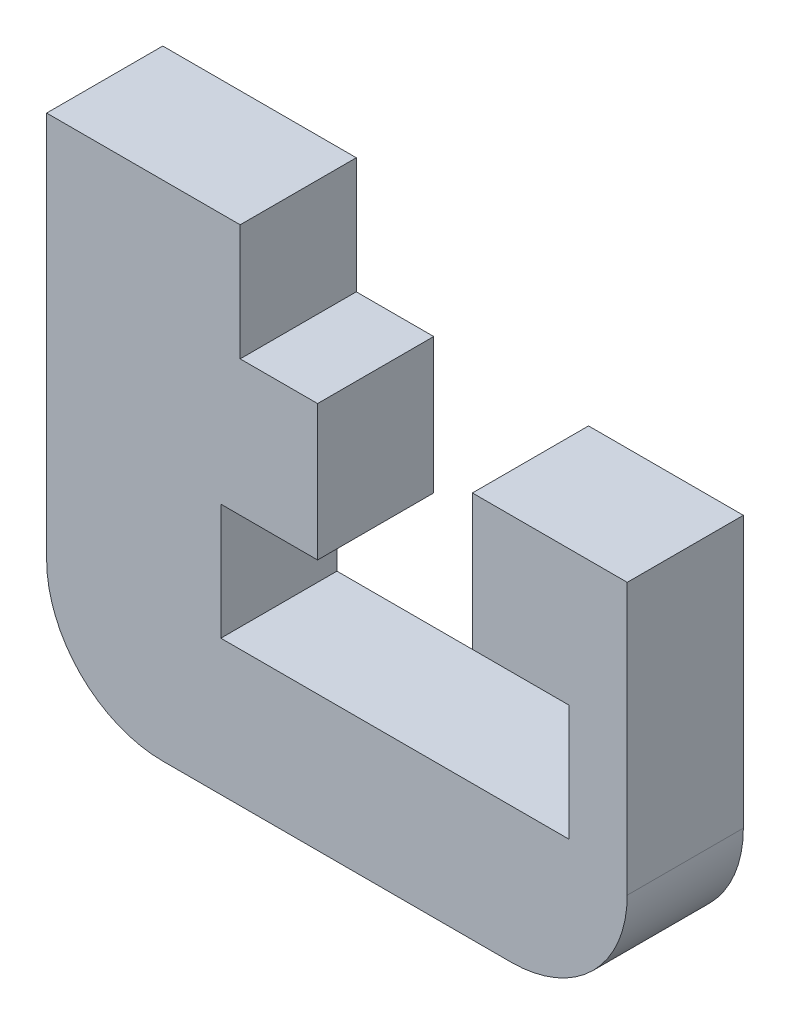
ISO-10303-21;
HEADER;
FILE_DESCRIPTION(('STEP AP214'),'2;1');
FILE_NAME('part.step','',(''),(''),'','','');
FILE_SCHEMA(('AUTOMOTIVE_DESIGN { 1 0 10303 214 1 1 1 1 }'));
ENDSEC;
DATA;
#1=APPLICATION_CONTEXT('core data for automotive mechanical design processes');
#2=APPLICATION_PROTOCOL_DEFINITION('international standard','automotive_design',2000,#1);
#3=PRODUCT_CONTEXT('',#1,'mechanical');
#4=PRODUCT('Part','Part','',(#3));
#5=PRODUCT_RELATED_PRODUCT_CATEGORY('part','',(#4));
#6=PRODUCT_DEFINITION_FORMATION('','',#4);
#7=PRODUCT_DEFINITION_CONTEXT('part definition',#1,'design');
#8=PRODUCT_DEFINITION('design','',#6,#7);
#9=PRODUCT_DEFINITION_SHAPE('','',#8);
#10=(LENGTH_UNIT() NAMED_UNIT(*) SI_UNIT(.MILLI.,.METRE.));
#11=(NAMED_UNIT(*) PLANE_ANGLE_UNIT() SI_UNIT($,.RADIAN.));
#12=(NAMED_UNIT(*) SI_UNIT($,.STERADIAN.) SOLID_ANGLE_UNIT());
#13=UNCERTAINTY_MEASURE_WITH_UNIT(LENGTH_MEASURE(1.E-05),#10,'distance_accuracy_value','');
#14=(GEOMETRIC_REPRESENTATION_CONTEXT(3) GLOBAL_UNCERTAINTY_ASSIGNED_CONTEXT((#13)) GLOBAL_UNIT_ASSIGNED_CONTEXT((#10,
#11,#12)) REPRESENTATION_CONTEXT('',''));
#15=CARTESIAN_POINT('',(0.,0.,0.));
#16=DIRECTION('',(0.,0.,1.));
#17=DIRECTION('',(1.,0.,0.));
#18=AXIS2_PLACEMENT_3D('',#15,#16,#17);
#19=CARTESIAN_POINT('',(-2.,12.0010272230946,3.));
#20=DIRECTION('',(0.,0.,-1.));
#21=DIRECTION('',(-1.,0.,0.));
#22=AXIS2_PLACEMENT_3D('',#19,#20,#21);
#23=CYLINDRICAL_SURFACE('',#22,3.);
#24=CARTESIAN_POINT('',(-2.,12.0010272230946,0.));
#25=DIRECTION('',(0.,0.,1.));
#26=DIRECTION('',(1.,0.,0.));
#27=AXIS2_PLACEMENT_3D('',#24,#25,#26);
#28=CIRCLE('',#27,3.);
#29=CARTESIAN_POINT('',(-5.,12.0010272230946,0.));
#30=VERTEX_POINT('',#29);
#31=CARTESIAN_POINT('',(-1.99999999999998,9.00102722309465,0.));
#32=VERTEX_POINT('',#31);
#33=EDGE_CURVE('E179',#30,#32,#28,.T.);
#34=ORIENTED_EDGE('',*,*,#33,.T.);
#35=DIRECTION('',(0.,0.,-1.));
#36=VECTOR('',#35,1.);
#37=CARTESIAN_POINT('',(-1.99999999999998,9.00102722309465,3.));
#38=LINE('',#37,#36);
#39=CARTESIAN_POINT('',(-1.99999999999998,9.00102722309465,3.));
#40=VERTEX_POINT('',#39);
#41=EDGE_CURVE('E11',#40,#32,#38,.T.);
#42=ORIENTED_EDGE('',*,*,#41,.F.);
#43=CARTESIAN_POINT('',(-2.,12.0010272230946,3.));
#44=DIRECTION('',(0.,0.,1.));
#45=DIRECTION('',(1.,0.,0.));
#46=AXIS2_PLACEMENT_3D('',#43,#44,#45);
#47=CIRCLE('',#46,3.);
#48=CARTESIAN_POINT('',(-5.,12.0010272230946,3.));
#49=VERTEX_POINT('',#48);
#50=EDGE_CURVE('E209',#49,#40,#47,.T.);
#51=ORIENTED_EDGE('',*,*,#50,.F.);
#52=DIRECTION('',(0.,0.,-1.));
#53=VECTOR('',#52,1.);
#54=CARTESIAN_POINT('',(-5.,12.0010272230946,3.));
#55=LINE('',#54,#53);
#56=EDGE_CURVE('E175',#49,#30,#55,.T.);
#57=ORIENTED_EDGE('',*,*,#56,.T.);
#58=EDGE_LOOP('',(#34,#42,#51,#57));
#59=FACE_BOUND('',#58,.T.);
#60=ADVANCED_FACE('F35',(#59),#23,.T.);
#61=CARTESIAN_POINT('',(6.99999999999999,9.00102722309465,3.));
#62=DIRECTION('',(0.,1.,0.));
#63=DIRECTION('',(0.,0.,1.));
#64=AXIS2_PLACEMENT_3D('',#61,#62,#63);
#65=PLANE('',#64);
#66=DIRECTION('',(1.,0.,0.));
#67=VECTOR('',#66,1.);
#68=CARTESIAN_POINT('',(6.99999999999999,9.00102722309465,0.));
#69=LINE('',#68,#67);
#70=CARTESIAN_POINT('',(6.99999999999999,9.00102722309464,0.));
#71=VERTEX_POINT('',#70);
#72=EDGE_CURVE('E182',#32,#71,#69,.T.);
#73=ORIENTED_EDGE('',*,*,#72,.T.);
#74=DIRECTION('',(0.,0.,-1.));
#75=VECTOR('',#74,1.);
#76=CARTESIAN_POINT('',(6.99999999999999,9.00102722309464,3.));
#77=LINE('',#76,#75);
#78=CARTESIAN_POINT('',(6.99999999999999,9.00102722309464,3.));
#79=VERTEX_POINT('',#78);
#80=EDGE_CURVE('E43',#79,#71,#77,.T.);
#81=ORIENTED_EDGE('',*,*,#80,.F.);
#82=DIRECTION('',(1.,0.,0.));
#83=VECTOR('',#82,1.);
#84=CARTESIAN_POINT('',(6.99999999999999,9.00102722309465,3.));
#85=LINE('',#84,#83);
#86=EDGE_CURVE('E118',#40,#79,#85,.T.);
#87=ORIENTED_EDGE('',*,*,#86,.F.);
#88=ORIENTED_EDGE('',*,*,#41,.T.);
#89=EDGE_LOOP('',(#73,#81,#87,#88));
#90=FACE_BOUND('',#89,.T.);
#91=ADVANCED_FACE('F307',(#90),#65,.F.);
#92=CARTESIAN_POINT('',(6.99999999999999,12.0010272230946,3.));
#93=DIRECTION('',(0.,0.,-1.));
#94=DIRECTION('',(-1.,0.,0.));
#95=AXIS2_PLACEMENT_3D('',#92,#93,#94);
#96=CYLINDRICAL_SURFACE('',#95,3.);
#97=CARTESIAN_POINT('',(6.99999999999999,12.0010272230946,0.));
#98=DIRECTION('',(0.,0.,1.));
#99=DIRECTION('',(-1.,0.,0.));
#100=AXIS2_PLACEMENT_3D('',#97,#98,#99);
#101=CIRCLE('',#100,3.);
#102=CARTESIAN_POINT('',(9.99999999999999,12.0010272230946,0.));
#103=VERTEX_POINT('',#102);
#104=EDGE_CURVE('E184',#71,#103,#101,.T.);
#105=ORIENTED_EDGE('',*,*,#104,.T.);
#106=DIRECTION('',(0.,0.,-1.));
#107=VECTOR('',#106,1.);
#108=CARTESIAN_POINT('',(9.99999999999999,12.0010272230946,3.));
#109=LINE('',#108,#107);
#110=CARTESIAN_POINT('',(9.99999999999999,12.0010272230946,3.));
#111=VERTEX_POINT('',#110);
#112=EDGE_CURVE('E240',#111,#103,#109,.T.);
#113=ORIENTED_EDGE('',*,*,#112,.F.);
#114=CARTESIAN_POINT('',(6.99999999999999,12.0010272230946,3.));
#115=DIRECTION('',(0.,0.,1.));
#116=DIRECTION('',(-1.,0.,0.));
#117=AXIS2_PLACEMENT_3D('',#114,#115,#116);
#118=CIRCLE('',#117,3.);
#119=EDGE_CURVE('E248',#79,#111,#118,.T.);
#120=ORIENTED_EDGE('',*,*,#119,.F.);
#121=ORIENTED_EDGE('',*,*,#80,.T.);
#122=EDGE_LOOP('',(#105,#113,#120,#121));
#123=FACE_BOUND('',#122,.T.);
#124=ADVANCED_FACE('F246',(#123),#96,.T.);
#125=CARTESIAN_POINT('',(9.99999999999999,19.0010272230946,3.));
#126=DIRECTION('',(-1.,0.,0.));
#127=DIRECTION('',(0.,0.,1.));
#128=AXIS2_PLACEMENT_3D('',#125,#126,#127);
#129=PLANE('',#128);
#130=DIRECTION('',(0.,1.,0.));
#131=VECTOR('',#130,1.);
#132=CARTESIAN_POINT('',(9.99999999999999,19.0010272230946,0.));
#133=LINE('',#132,#131);
#134=CARTESIAN_POINT('',(9.99999999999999,19.0010272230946,0.));
#135=VERTEX_POINT('',#134);
#136=EDGE_CURVE('E186',#103,#135,#133,.T.);
#137=ORIENTED_EDGE('',*,*,#136,.T.);
#138=DIRECTION('',(0.,0.,-1.));
#139=VECTOR('',#138,1.);
#140=CARTESIAN_POINT('',(9.99999999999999,19.0010272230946,3.));
#141=LINE('',#140,#139);
#142=CARTESIAN_POINT('',(9.99999999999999,19.0010272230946,3.));
#143=VERTEX_POINT('',#142);
#144=EDGE_CURVE('E237',#143,#135,#141,.T.);
#145=ORIENTED_EDGE('',*,*,#144,.F.);
#146=DIRECTION('',(0.,1.,0.));
#147=VECTOR('',#146,1.);
#148=CARTESIAN_POINT('',(9.99999999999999,19.0010272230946,3.));
#149=LINE('',#148,#147);
#150=EDGE_CURVE('E266',#111,#143,#149,.T.);
#151=ORIENTED_EDGE('',*,*,#150,.F.);
#152=ORIENTED_EDGE('',*,*,#112,.T.);
#153=EDGE_LOOP('',(#137,#145,#151,#152));
#154=FACE_BOUND('',#153,.T.);
#155=ADVANCED_FACE('F257',(#154),#129,.F.);
#156=CARTESIAN_POINT('',(6.,19.0010272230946,3.));
#157=DIRECTION('',(0.,-1.,0.));
#158=DIRECTION('',(0.,0.,-1.));
#159=AXIS2_PLACEMENT_3D('',#156,#157,#158);
#160=PLANE('',#159);
#161=DIRECTION('',(-1.,0.,0.));
#162=VECTOR('',#161,1.);
#163=CARTESIAN_POINT('',(6.,19.0010272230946,0.));
#164=LINE('',#163,#162);
#165=CARTESIAN_POINT('',(6.,19.0010272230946,0.));
#166=VERTEX_POINT('',#165);
#167=EDGE_CURVE('E188',#135,#166,#164,.T.);
#168=ORIENTED_EDGE('',*,*,#167,.T.);
#169=DIRECTION('',(0.,0.,-1.));
#170=VECTOR('',#169,1.);
#171=CARTESIAN_POINT('',(6.,19.0010272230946,3.));
#172=LINE('',#171,#170);
#173=CARTESIAN_POINT('',(6.,19.0010272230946,3.));
#174=VERTEX_POINT('',#173);
#175=EDGE_CURVE('E234',#174,#166,#172,.T.);
#176=ORIENTED_EDGE('',*,*,#175,.F.);
#177=DIRECTION('',(-1.,0.,0.));
#178=VECTOR('',#177,1.);
#179=CARTESIAN_POINT('',(6.,19.0010272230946,3.));
#180=LINE('',#179,#178);
#181=EDGE_CURVE('E263',#143,#174,#180,.T.);
#182=ORIENTED_EDGE('',*,*,#181,.F.);
#183=ORIENTED_EDGE('',*,*,#144,.T.);
#184=EDGE_LOOP('',(#168,#176,#182,#183));
#185=FACE_BOUND('',#184,.T.);
#186=ADVANCED_FACE('F261',(#185),#160,.F.);
#187=CARTESIAN_POINT('',(6.,19.0010272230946,3.));
#188=DIRECTION('',(1.,0.,0.));
#189=DIRECTION('',(0.,0.,-1.));
#190=AXIS2_PLACEMENT_3D('',#187,#188,#189);
#191=PLANE('',#190);
#192=DIRECTION('',(0.,-1.,0.));
#193=VECTOR('',#192,1.);
#194=CARTESIAN_POINT('',(6.,19.0010272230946,0.));
#195=LINE('',#194,#193);
#196=CARTESIAN_POINT('',(6.,15.5010272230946,0.));
#197=VERTEX_POINT('',#196);
#198=EDGE_CURVE('E190',#166,#197,#195,.T.);
#199=ORIENTED_EDGE('',*,*,#198,.T.);
#200=DIRECTION('',(0.,0.,-1.));
#201=VECTOR('',#200,1.);
#202=CARTESIAN_POINT('',(6.,15.5010272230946,3.));
#203=LINE('',#202,#201);
#204=CARTESIAN_POINT('',(6.,15.5010272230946,3.));
#205=VERTEX_POINT('',#204);
#206=EDGE_CURVE('E231',#205,#197,#203,.T.);
#207=ORIENTED_EDGE('',*,*,#206,.F.);
#208=DIRECTION('',(0.,-1.,0.));
#209=VECTOR('',#208,1.);
#210=CARTESIAN_POINT('',(6.,19.0010272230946,3.));
#211=LINE('',#210,#209);
#212=EDGE_CURVE('E265',#174,#205,#211,.T.);
#213=ORIENTED_EDGE('',*,*,#212,.F.);
#214=ORIENTED_EDGE('',*,*,#175,.T.);
#215=EDGE_LOOP('',(#199,#207,#213,#214));
#216=FACE_BOUND('',#215,.T.);
#217=ADVANCED_FACE('F320',(#216),#191,.F.);
#218=CARTESIAN_POINT('',(6.,15.5010272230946,3.));
#219=DIRECTION('',(0.,1.,0.));
#220=DIRECTION('',(0.,0.,1.));
#221=AXIS2_PLACEMENT_3D('',#218,#219,#220);
#222=PLANE('',#221);
#223=DIRECTION('',(1.,0.,0.));
#224=VECTOR('',#223,1.);
#225=CARTESIAN_POINT('',(6.,15.5010272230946,0.));
#226=LINE('',#225,#224);
#227=CARTESIAN_POINT('',(8.5,15.5010272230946,0.));
#228=VERTEX_POINT('',#227);
#229=EDGE_CURVE('E192',#197,#228,#226,.T.);
#230=ORIENTED_EDGE('',*,*,#229,.T.);
#231=DIRECTION('',(0.,0.,-1.));
#232=VECTOR('',#231,1.);
#233=CARTESIAN_POINT('',(8.5,15.5010272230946,3.));
#234=LINE('',#233,#232);
#235=CARTESIAN_POINT('',(8.5,15.5010272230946,3.));
#236=VERTEX_POINT('',#235);
#237=EDGE_CURVE('E228',#236,#228,#234,.T.);
#238=ORIENTED_EDGE('',*,*,#237,.F.);
#239=DIRECTION('',(1.,0.,0.));
#240=VECTOR('',#239,1.);
#241=CARTESIAN_POINT('',(6.,15.5010272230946,3.));
#242=LINE('',#241,#240);
#243=EDGE_CURVE('E268',#205,#236,#242,.T.);
#244=ORIENTED_EDGE('',*,*,#243,.F.);
#245=ORIENTED_EDGE('',*,*,#206,.T.);
#246=EDGE_LOOP('',(#230,#238,#244,#245));
#247=FACE_BOUND('',#246,.T.);
#248=ADVANCED_FACE('F323',(#247),#222,.F.);
#249=CARTESIAN_POINT('',(8.5,15.5010272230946,3.));
#250=DIRECTION('',(1.,0.,0.));
#251=DIRECTION('',(0.,0.,-1.));
#252=AXIS2_PLACEMENT_3D('',#249,#250,#251);
#253=PLANE('',#252);
#254=DIRECTION('',(0.,-1.,0.));
#255=VECTOR('',#254,1.);
#256=CARTESIAN_POINT('',(8.5,15.5010272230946,0.));
#257=LINE('',#256,#255);
#258=CARTESIAN_POINT('',(8.5,12.5010272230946,0.));
#259=VERTEX_POINT('',#258);
#260=EDGE_CURVE('E194',#228,#259,#257,.T.);
#261=ORIENTED_EDGE('',*,*,#260,.T.);
#262=DIRECTION('',(0.,0.,-1.));
#263=VECTOR('',#262,1.);
#264=CARTESIAN_POINT('',(8.5,12.5010272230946,3.));
#265=LINE('',#264,#263);
#266=CARTESIAN_POINT('',(8.5,12.5010272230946,3.));
#267=VERTEX_POINT('',#266);
#268=EDGE_CURVE('E225',#267,#259,#265,.T.);
#269=ORIENTED_EDGE('',*,*,#268,.F.);
#270=DIRECTION('',(0.,-1.,0.));
#271=VECTOR('',#270,1.);
#272=CARTESIAN_POINT('',(8.5,15.5010272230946,3.));
#273=LINE('',#272,#271);
#274=EDGE_CURVE('E274',#236,#267,#273,.T.);
#275=ORIENTED_EDGE('',*,*,#274,.F.);
#276=ORIENTED_EDGE('',*,*,#237,.T.);
#277=EDGE_LOOP('',(#261,#269,#275,#276));
#278=FACE_BOUND('',#277,.T.);
#279=ADVANCED_FACE('F327',(#278),#253,.F.);
#280=CARTESIAN_POINT('',(8.5,12.5010272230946,3.));
#281=DIRECTION('',(0.,-1.,0.));
#282=DIRECTION('',(1.,0.,0.));
#283=AXIS2_PLACEMENT_3D('',#280,#281,#282);
#284=PLANE('',#283);
#285=DIRECTION('',(-1.,0.,0.));
#286=VECTOR('',#285,1.);
#287=CARTESIAN_POINT('',(8.5,12.5010272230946,0.));
#288=LINE('',#287,#286);
#289=CARTESIAN_POINT('',(-0.5,12.5010272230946,0.));
#290=VERTEX_POINT('',#289);
#291=EDGE_CURVE('E196',#259,#290,#288,.T.);
#292=ORIENTED_EDGE('',*,*,#291,.T.);
#293=DIRECTION('',(0.,0.,-1.));
#294=VECTOR('',#293,1.);
#295=CARTESIAN_POINT('',(-0.5,12.5010272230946,3.));
#296=LINE('',#295,#294);
#297=CARTESIAN_POINT('',(-0.5,12.5010272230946,3.));
#298=VERTEX_POINT('',#297);
#299=EDGE_CURVE('E222',#298,#290,#296,.T.);
#300=ORIENTED_EDGE('',*,*,#299,.F.);
#301=DIRECTION('',(-1.,0.,0.));
#302=VECTOR('',#301,1.);
#303=CARTESIAN_POINT('',(8.5,12.5010272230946,3.));
#304=LINE('',#303,#302);
#305=EDGE_CURVE('E276',#267,#298,#304,.T.);
#306=ORIENTED_EDGE('',*,*,#305,.F.);
#307=ORIENTED_EDGE('',*,*,#268,.T.);
#308=EDGE_LOOP('',(#292,#300,#306,#307));
#309=FACE_BOUND('',#308,.T.);
#310=ADVANCED_FACE('F331',(#309),#284,.F.);
#311=CARTESIAN_POINT('',(-0.5,12.5010272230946,3.));
#312=DIRECTION('',(-1.,0.,0.));
#313=DIRECTION('',(0.,0.,1.));
#314=AXIS2_PLACEMENT_3D('',#311,#312,#313);
#315=PLANE('',#314);
#316=DIRECTION('',(0.,1.,0.));
#317=VECTOR('',#316,1.);
#318=CARTESIAN_POINT('',(-0.5,12.5010272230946,0.));
#319=LINE('',#318,#317);
#320=CARTESIAN_POINT('',(-0.5,15.5010272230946,0.));
#321=VERTEX_POINT('',#320);
#322=EDGE_CURVE('E198',#290,#321,#319,.T.);
#323=ORIENTED_EDGE('',*,*,#322,.T.);
#324=DIRECTION('',(0.,0.,-1.));
#325=VECTOR('',#324,1.);
#326=CARTESIAN_POINT('',(-0.5,15.5010272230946,3.));
#327=LINE('',#326,#325);
#328=CARTESIAN_POINT('',(-0.5,15.5010272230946,3.));
#329=VERTEX_POINT('',#328);
#330=EDGE_CURVE('E219',#329,#321,#327,.T.);
#331=ORIENTED_EDGE('',*,*,#330,.F.);
#332=DIRECTION('',(0.,1.,0.));
#333=VECTOR('',#332,1.);
#334=CARTESIAN_POINT('',(-0.5,12.5010272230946,3.));
#335=LINE('',#334,#333);
#336=EDGE_CURVE('E278',#298,#329,#335,.T.);
#337=ORIENTED_EDGE('',*,*,#336,.F.);
#338=ORIENTED_EDGE('',*,*,#299,.T.);
#339=EDGE_LOOP('',(#323,#331,#337,#338));
#340=FACE_BOUND('',#339,.T.);
#341=ADVANCED_FACE('F335',(#340),#315,.F.);
#342=CARTESIAN_POINT('',(-0.5,15.5010272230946,3.));
#343=DIRECTION('',(0.,1.,0.));
#344=DIRECTION('',(0.,0.,1.));
#345=AXIS2_PLACEMENT_3D('',#342,#343,#344);
#346=PLANE('',#345);
#347=DIRECTION('',(1.,0.,0.));
#348=VECTOR('',#347,1.);
#349=CARTESIAN_POINT('',(-0.5,15.5010272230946,0.));
#350=LINE('',#349,#348);
#351=CARTESIAN_POINT('',(2.,15.5010272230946,0.));
#352=VERTEX_POINT('',#351);
#353=EDGE_CURVE('E200',#321,#352,#350,.T.);
#354=ORIENTED_EDGE('',*,*,#353,.T.);
#355=DIRECTION('',(0.,0.,-1.));
#356=VECTOR('',#355,1.);
#357=CARTESIAN_POINT('',(2.,15.5010272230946,3.));
#358=LINE('',#357,#356);
#359=CARTESIAN_POINT('',(2.,15.5010272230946,3.));
#360=VERTEX_POINT('',#359);
#361=EDGE_CURVE('E216',#360,#352,#358,.T.);
#362=ORIENTED_EDGE('',*,*,#361,.F.);
#363=DIRECTION('',(1.,0.,0.));
#364=VECTOR('',#363,1.);
#365=CARTESIAN_POINT('',(-0.5,15.5010272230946,3.));
#366=LINE('',#365,#364);
#367=EDGE_CURVE('E280',#329,#360,#366,.T.);
#368=ORIENTED_EDGE('',*,*,#367,.F.);
#369=ORIENTED_EDGE('',*,*,#330,.T.);
#370=EDGE_LOOP('',(#354,#362,#368,#369));
#371=FACE_BOUND('',#370,.T.);
#372=ADVANCED_FACE('F339',(#371),#346,.F.);
#373=CARTESIAN_POINT('',(2.,15.5010272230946,3.));
#374=DIRECTION('',(-1.,0.,0.));
#375=DIRECTION('',(0.,0.,1.));
#376=AXIS2_PLACEMENT_3D('',#373,#374,#375);
#377=PLANE('',#376);
#378=DIRECTION('',(0.,1.,0.));
#379=VECTOR('',#378,1.);
#380=CARTESIAN_POINT('',(2.,15.5010272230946,0.));
#381=LINE('',#380,#379);
#382=CARTESIAN_POINT('',(2.,19.0010272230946,0.));
#383=VERTEX_POINT('',#382);
#384=EDGE_CURVE('E202',#352,#383,#381,.T.);
#385=ORIENTED_EDGE('',*,*,#384,.T.);
#386=DIRECTION('',(0.,0.,-1.));
#387=VECTOR('',#386,1.);
#388=CARTESIAN_POINT('',(2.,19.0010272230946,3.));
#389=LINE('',#388,#387);
#390=CARTESIAN_POINT('',(2.,19.0010272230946,3.));
#391=VERTEX_POINT('',#390);
#392=EDGE_CURVE('E213',#391,#383,#389,.T.);
#393=ORIENTED_EDGE('',*,*,#392,.F.);
#394=DIRECTION('',(0.,1.,0.));
#395=VECTOR('',#394,1.);
#396=CARTESIAN_POINT('',(2.,15.5010272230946,3.));
#397=LINE('',#396,#395);
#398=EDGE_CURVE('E282',#360,#391,#397,.T.);
#399=ORIENTED_EDGE('',*,*,#398,.F.);
#400=ORIENTED_EDGE('',*,*,#361,.T.);
#401=EDGE_LOOP('',(#385,#393,#399,#400));
#402=FACE_BOUND('',#401,.T.);
#403=ADVANCED_FACE('F288',(#402),#377,.F.);
#404=CARTESIAN_POINT('',(2.,19.0010272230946,3.));
#405=DIRECTION('',(0.,-1.,0.));
#406=DIRECTION('',(0.,0.,-1.));
#407=AXIS2_PLACEMENT_3D('',#404,#405,#406);
#408=PLANE('',#407);
#409=DIRECTION('',(-1.,0.,0.));
#410=VECTOR('',#409,1.);
#411=CARTESIAN_POINT('',(2.,19.0010272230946,0.));
#412=LINE('',#411,#410);
#413=CARTESIAN_POINT('',(0.,19.0010272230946,0.));
#414=VERTEX_POINT('',#413);
#415=EDGE_CURVE('E204',#383,#414,#412,.T.);
#416=ORIENTED_EDGE('',*,*,#415,.T.);
#417=DIRECTION('',(0.,0.,-1.));
#418=VECTOR('',#417,1.);
#419=CARTESIAN_POINT('',(0.,19.0010272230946,3.));
#420=LINE('',#419,#418);
#421=CARTESIAN_POINT('',(0.,19.0010272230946,3.));
#422=VERTEX_POINT('',#421);
#423=EDGE_CURVE('E170',#422,#414,#420,.T.);
#424=ORIENTED_EDGE('',*,*,#423,.F.);
#425=DIRECTION('',(-1.,0.,0.));
#426=VECTOR('',#425,1.);
#427=CARTESIAN_POINT('',(2.,19.0010272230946,3.));
#428=LINE('',#427,#426);
#429=EDGE_CURVE('E161',#391,#422,#428,.T.);
#430=ORIENTED_EDGE('',*,*,#429,.F.);
#431=ORIENTED_EDGE('',*,*,#392,.T.);
#432=EDGE_LOOP('',(#416,#424,#430,#431));
#433=FACE_BOUND('',#432,.T.);
#434=ADVANCED_FACE('F292',(#433),#408,.F.);
#435=CARTESIAN_POINT('',(0.,19.0010272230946,3.));
#436=DIRECTION('',(-1.,0.,0.));
#437=DIRECTION('',(0.,0.,1.));
#438=AXIS2_PLACEMENT_3D('',#435,#436,#437);
#439=PLANE('',#438);
#440=DIRECTION('',(0.,1.,0.));
#441=VECTOR('',#440,1.);
#442=CARTESIAN_POINT('',(0.,19.0010272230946,0.));
#443=LINE('',#442,#441);
#444=CARTESIAN_POINT('',(0.,22.0010272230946,0.));
#445=VERTEX_POINT('',#444);
#446=EDGE_CURVE('E169',#414,#445,#443,.T.);
#447=ORIENTED_EDGE('',*,*,#446,.T.);
#448=DIRECTION('',(0.,0.,-1.));
#449=VECTOR('',#448,1.);
#450=CARTESIAN_POINT('',(0.,22.0010272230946,3.));
#451=LINE('',#450,#449);
#452=CARTESIAN_POINT('',(0.,22.0010272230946,3.));
#453=VERTEX_POINT('',#452);
#454=EDGE_CURVE('E166',#453,#445,#451,.T.);
#455=ORIENTED_EDGE('',*,*,#454,.F.);
#456=DIRECTION('',(0.,1.,0.));
#457=VECTOR('',#456,1.);
#458=CARTESIAN_POINT('',(0.,19.0010272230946,3.));
#459=LINE('',#458,#457);
#460=EDGE_CURVE('E155',#422,#453,#459,.T.);
#461=ORIENTED_EDGE('',*,*,#460,.F.);
#462=ORIENTED_EDGE('',*,*,#423,.T.);
#463=EDGE_LOOP('',(#447,#455,#461,#462));
#464=FACE_BOUND('',#463,.T.);
#465=ADVANCED_FACE('F167',(#464),#439,.F.);
#466=CARTESIAN_POINT('',(0.,22.0010272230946,3.));
#467=DIRECTION('',(0.,-1.,0.));
#468=DIRECTION('',(0.,0.,-1.));
#469=AXIS2_PLACEMENT_3D('',#466,#467,#468);
#470=PLANE('',#469);
#471=DIRECTION('',(-1.,0.,0.));
#472=VECTOR('',#471,1.);
#473=CARTESIAN_POINT('',(0.,22.0010272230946,0.));
#474=LINE('',#473,#472);
#475=CARTESIAN_POINT('',(-5.,22.0010272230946,0.));
#476=VERTEX_POINT('',#475);
#477=EDGE_CURVE('E104',#445,#476,#474,.T.);
#478=ORIENTED_EDGE('',*,*,#477,.T.);
#479=DIRECTION('',(0.,0.,-1.));
#480=VECTOR('',#479,1.);
#481=CARTESIAN_POINT('',(-5.,22.0010272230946,3.));
#482=LINE('',#481,#480);
#483=CARTESIAN_POINT('',(-5.,22.0010272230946,3.));
#484=VERTEX_POINT('',#483);
#485=EDGE_CURVE('E171',#484,#476,#482,.T.);
#486=ORIENTED_EDGE('',*,*,#485,.F.);
#487=DIRECTION('',(-1.,0.,0.));
#488=VECTOR('',#487,1.);
#489=CARTESIAN_POINT('',(0.,22.0010272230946,3.));
#490=LINE('',#489,#488);
#491=EDGE_CURVE('E159',#453,#484,#490,.T.);
#492=ORIENTED_EDGE('',*,*,#491,.F.);
#493=ORIENTED_EDGE('',*,*,#454,.T.);
#494=EDGE_LOOP('',(#478,#486,#492,#493));
#495=FACE_BOUND('',#494,.T.);
#496=ADVANCED_FACE('F173',(#495),#470,.F.);
#497=CARTESIAN_POINT('',(-5.,22.0010272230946,3.));
#498=DIRECTION('',(1.,0.,0.));
#499=DIRECTION('',(0.,1.,0.));
#500=AXIS2_PLACEMENT_3D('',#497,#498,#499);
#501=PLANE('',#500);
#502=DIRECTION('',(0.,-1.,0.));
#503=VECTOR('',#502,1.);
#504=CARTESIAN_POINT('',(-5.,22.0010272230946,0.));
#505=LINE('',#504,#503);
#506=EDGE_CURVE('E110',#476,#30,#505,.T.);
#507=ORIENTED_EDGE('',*,*,#506,.T.);
#508=ORIENTED_EDGE('',*,*,#56,.F.);
#509=DIRECTION('',(0.,-1.,0.));
#510=VECTOR('',#509,1.);
#511=CARTESIAN_POINT('',(-5.,22.0010272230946,3.));
#512=LINE('',#511,#510);
#513=EDGE_CURVE('E51',#484,#49,#512,.T.);
#514=ORIENTED_EDGE('',*,*,#513,.F.);
#515=ORIENTED_EDGE('',*,*,#485,.T.);
#516=EDGE_LOOP('',(#507,#508,#514,#515));
#517=FACE_BOUND('',#516,.T.);
#518=ADVANCED_FACE('F296',(#517),#501,.F.);
#519=CARTESIAN_POINT('',(-2.,12.0010272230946,3.));
#520=DIRECTION('',(0.,0.,1.));
#521=DIRECTION('',(1.,0.,0.));
#522=AXIS2_PLACEMENT_3D('',#519,#520,#521);
#523=PLANE('',#522);
#524=ORIENTED_EDGE('',*,*,#50,.T.);
#525=ORIENTED_EDGE('',*,*,#86,.T.);
#526=ORIENTED_EDGE('',*,*,#119,.T.);
#527=ORIENTED_EDGE('',*,*,#150,.T.);
#528=ORIENTED_EDGE('',*,*,#181,.T.);
#529=ORIENTED_EDGE('',*,*,#212,.T.);
#530=ORIENTED_EDGE('',*,*,#243,.T.);
#531=ORIENTED_EDGE('',*,*,#274,.T.);
#532=ORIENTED_EDGE('',*,*,#305,.T.);
#533=ORIENTED_EDGE('',*,*,#336,.T.);
#534=ORIENTED_EDGE('',*,*,#367,.T.);
#535=ORIENTED_EDGE('',*,*,#398,.T.);
#536=ORIENTED_EDGE('',*,*,#429,.T.);
#537=ORIENTED_EDGE('',*,*,#460,.T.);
#538=ORIENTED_EDGE('',*,*,#491,.T.);
#539=ORIENTED_EDGE('',*,*,#513,.T.);
#540=EDGE_LOOP('',(#524,#525,#526,#527,#528,#529,#530,#531,#532,#533,#534,#535,#536,#537,#538,#539));
#541=FACE_BOUND('',#540,.T.);
#542=ADVANCED_FACE('F157',(#541),#523,.T.);
#543=CARTESIAN_POINT('',(-2.,12.0010272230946,0.));
#544=DIRECTION('',(0.,0.,1.));
#545=DIRECTION('',(1.,0.,0.));
#546=AXIS2_PLACEMENT_3D('',#543,#544,#545);
#547=PLANE('',#546);
#548=ORIENTED_EDGE('',*,*,#33,.F.);
#549=ORIENTED_EDGE('',*,*,#506,.F.);
#550=ORIENTED_EDGE('',*,*,#477,.F.);
#551=ORIENTED_EDGE('',*,*,#446,.F.);
#552=ORIENTED_EDGE('',*,*,#415,.F.);
#553=ORIENTED_EDGE('',*,*,#384,.F.);
#554=ORIENTED_EDGE('',*,*,#353,.F.);
#555=ORIENTED_EDGE('',*,*,#322,.F.);
#556=ORIENTED_EDGE('',*,*,#291,.F.);
#557=ORIENTED_EDGE('',*,*,#260,.F.);
#558=ORIENTED_EDGE('',*,*,#229,.F.);
#559=ORIENTED_EDGE('',*,*,#198,.F.);
#560=ORIENTED_EDGE('',*,*,#167,.F.);
#561=ORIENTED_EDGE('',*,*,#136,.F.);
#562=ORIENTED_EDGE('',*,*,#104,.F.);
#563=ORIENTED_EDGE('',*,*,#72,.F.);
#564=EDGE_LOOP('',(#548,#549,#550,#551,#552,#553,#554,#555,#556,#557,#558,#559,#560,#561,#562,#563));
#565=FACE_BOUND('',#564,.T.);
#566=ADVANCED_FACE('F252',(#565),#547,.F.);
#567=CLOSED_SHELL('',(#60,#91,#124,#155,#186,#217,#248,#279,#310,#341,#372,#403,#434,#465,#496,
#518,#542,#566));
#568=MANIFOLD_SOLID_BREP('B2',#567);
#569=ADVANCED_BREP_SHAPE_REPRESENTATION('',(#18,#568),#14);
#570=SHAPE_DEFINITION_REPRESENTATION(#9,#569);
ENDSEC;
END-ISO-10303-21;
